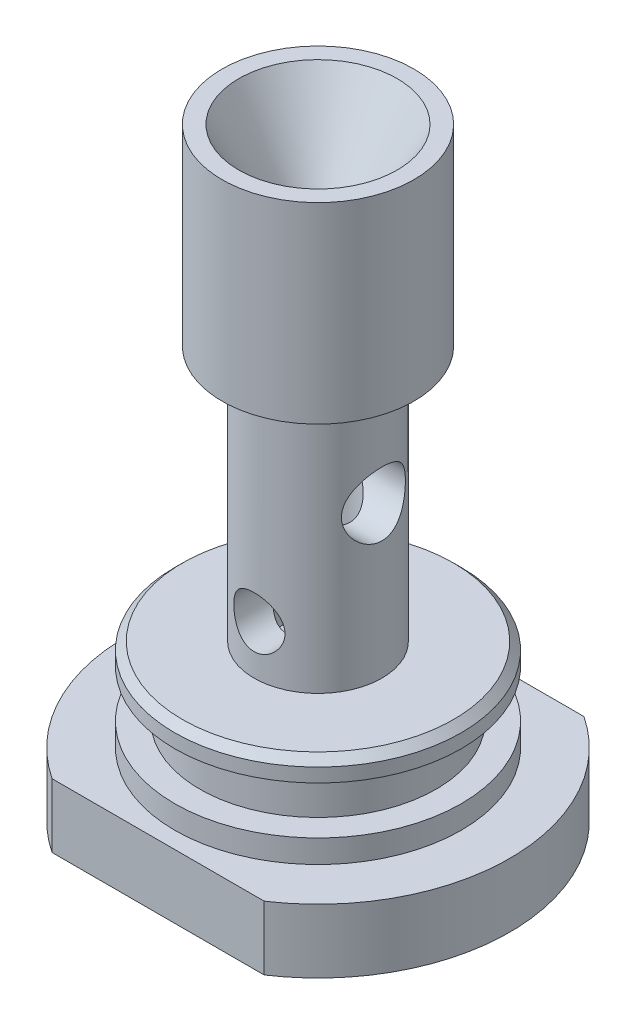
from build123d import *

# Parameters (mm, degrees)
CHAMFER1_SIZE           = 0.381
CHAMFER2_SIZE           = 4.064
CHAMFER2_SIZE2          = 2.346351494
CUT_EXTRUDE1_DEPTH      = 33.85982052
CUT_EXTRUDE1_DEPTH_BACK = 33.85982052
SKETCH2_R               = 1.27
CUT_EXTRUDE2_DEPTH      = 33.85982052
CUT_EXTRUDE2_DEPTH_BACK = 33.85982052
SKETCH3_R               = 1.5875
SKETCH4_OUTSIDE_W       = 29.11
SKETCH4_OUTSIDE_H       = 29.11
CUT_EXTRUDE3_DEPTH      = 33.85982052


with BuildPart() as part:
    # Sketch1 → Revolve1 (revolve)
    with BuildSketch(Plane.XY, mode=Mode.PRIVATE) as revolve1_sk:
        Polygon((0, 0), (9.525, 0), (9.525, 3.175), (7.112, 3.175), (7.112, 4.317964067), (5.8674, 4.317964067), (5.8674, 6.680164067), (7.112, 6.680164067), (7.112, 7.746929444), (3.175, 7.746929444), (3.175, 20.446929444), (4.7625, 20.446929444), (4.7625, 29.971929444), (1.5875, 29.971929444), (1.5875, 7.747), (0, 7.747), align=None)
    revolve(revolve1_sk.sketch.rotate(Axis((0, 0, 0), (0, 1, 0)), 90), axis=Axis((0, 0, 0), (0, 1, 0)))

    # Chamfer1
    chamfer1_edges = [part.edges().sort_by_distance(p)[0] for p in [
        (0, 7.746929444, 7.112),
    ]]
    chamfer(chamfer1_edges, length=CHAMFER1_SIZE)

    # Chamfer2
    chamfer2_edges = [part.edges().sort_by_distance(p)[0] for p in [
        (0, 29.971929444, 1.5875),
    ]]
    chamfer2_side = [part.faces().sort_by_distance(p)[0] for p in [
        (0, 18.859464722, 1.5875),
    ]]
    chamfer(chamfer2_edges, length=CHAMFER2_SIZE, length2=CHAMFER2_SIZE2, reference=chamfer2_side[0])

    # Sketch2 → Cut-Extrude1 (cut, two sides: drawn at the far end of the back side and taken through both)
    with BuildSketch(Plane.XY.offset(-CUT_EXTRUDE1_DEPTH_BACK)):
        with Locations((0, 10.16)):
            Circle(SKETCH2_R)
    extrude(amount=CUT_EXTRUDE1_DEPTH + CUT_EXTRUDE1_DEPTH_BACK, mode=Mode.SUBTRACT)

    # Sketch3 → Cut-Extrude2 (cut, two sides: drawn at the far end of the back side and taken through both)
    with BuildSketch(Plane(origin=(0, 0, 0), x_dir=(0, 0, -1), z_dir=(1, 0, 0)).offset(-CUT_EXTRUDE2_DEPTH_BACK)):
        with Locations((0, 15.24)):
            Circle(SKETCH3_R)
    extrude(amount=CUT_EXTRUDE2_DEPTH + CUT_EXTRUDE2_DEPTH_BACK, mode=Mode.SUBTRACT)

    # Sketch4 outside → Cut-Extrude3 (cut, through all)
    with BuildSketch(Plane.XZ):
        Rectangle(SKETCH4_OUTSIDE_W, SKETCH4_OUTSIDE_H)
        Polygon((0, -7.9375), (12.7, -7.9375), (12.7, 7.9375), (-12.7, 7.9375), (-12.7, -7.9375), align=None, mode=Mode.SUBTRACT)
    extrude(amount=-CUT_EXTRUDE3_DEPTH, mode=Mode.SUBTRACT)


solid = part.part
